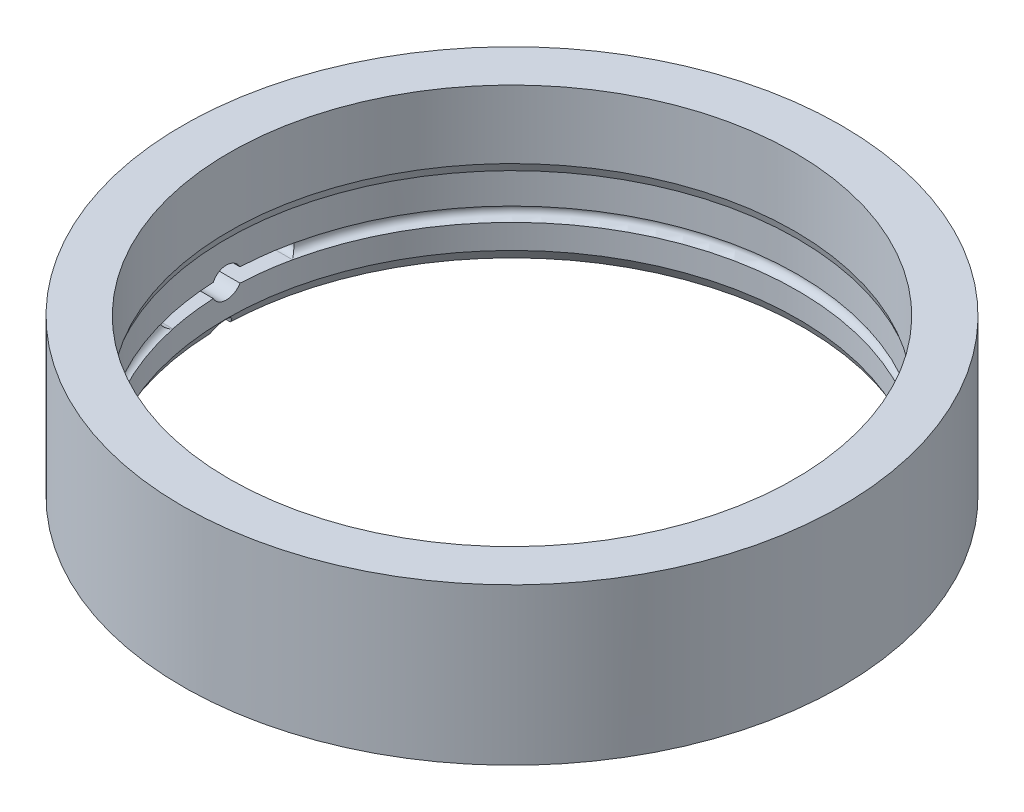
from build123d import *
from build123d.topology import SkipClean

# Parameters (mm, degrees)
SKETCH1_R           = 83.185
SKETCH1_R_2         = 71.3486
BOSS_EXTRUDE1_DEPTH = 29.2862
CHAMFER1_SIZE       = 1.5875
CHAMFER1_SIZE2      = 2.749630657
CUT_EXTRUDE3_START  = -12.675881
CUT_EXTRUDE3_DEPTH  = 12.675881
BOSS_EXTRUDE2_START = 10.16
SKETCH14_R          = 83.185
SKETCH14_R_2        = 72.1106
BOSS_EXTRUDE2_DEPTH = 10.16


with BuildPart() as part:
    # Sketch1 → Boss-Extrude1 (new body)
    with BuildSketch(Plane(origin=(0, 0, 0), x_dir=(1, 0, 0), z_dir=(0, 1, 0))):
        with Locations(Location((0, 0, 0), (0, 0, 270))):
            Circle(SKETCH1_R)
        with Locations(Location((0, 0, 0), (0, 0, 270))):
            Circle(SKETCH1_R_2, mode=Mode.SUBTRACT)
    extrude(amount=BOSS_EXTRUDE1_DEPTH)

    # Sketch4 → Cut-Revolve2 (revolve, cut)
    with BuildSketch(Plane(origin=(0, 0, 0), x_dir=(-1, 0, 0), z_dir=(0, 0, -1)), mode=Mode.PRIVATE) as cut_revolve2_sk:
        with BuildLine():
            Line((71.3486, 0), (72.1106, 0))
            Line((72.1106, 0), (72.1106, 8.89))
            ThreePointArc((72.1106, 8.89), (73.8886, 10.668), (72.1106, 12.446))
            Line((72.1106, 12.446), (72.1106, 29.2862))
            Line((72.1106, 29.2862), (71.3486, 29.2862))
            Line((71.3486, 29.2862), (71.3486, 0))
        make_face()
    revolve(cut_revolve2_sk.sketch.rotate(Axis((0, 0, 0), (0, 1, 0)), 270), axis=Axis((0, 0, 0), (0, 1, 0)), mode=Mode.SUBTRACT)

    # Chamfer1
    chamfer1_edges = [part.edges().sort_by_distance(p)[0] for p in [
        (0, 0, 72.1106),
    ]]
    chamfer1_side = [part.faces().sort_by_distance(p)[0] for p in [
        (0, 0, -80.832172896),
    ]]
    chamfer(chamfer1_edges, length=CHAMFER1_SIZE, length2=CHAMFER1_SIZE2, reference=chamfer1_side[0])

    # Sketch13 → Cut-Extrude3 (cut)
    with BuildSketch(Plane.ZY.offset(83.185).offset(CUT_EXTRUDE3_START)):
        with BuildLine():
            Line((-3.369690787, 8.89), (0, 8.89))
            Line((0, 8.89), (0, 10.668))
            Line((0, 10.668), (-3.81, 10.668))
            ThreePointArc((-3.81, 10.668), (-3.698284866, 9.752145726), (-3.369690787, 8.89))
        make_face()
        with BuildLine():
            Line((0, 10.668), (0, 8.89))
            Line((0, 8.89), (3.369690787, 8.89))
            ThreePointArc((3.369690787, 8.89), (3.698284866, 9.752145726), (3.81, 10.668))
            Line((3.81, 10.668), (0, 10.668))
        make_face()
        with BuildLine():
            Line((-3.369690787, 8.89), (0, 8.89))
            Line((0, 8.89), (0, 10.668))
            Line((0, 10.668), (-3.81, 10.668))
            ThreePointArc((-3.81, 10.668), (-3.698284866, 9.752145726), (-3.369690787, 8.89))
        make_face()
        with BuildLine():
            Line((0, 10.668), (0, 8.89))
            Line((0, 8.89), (3.369690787, 8.89))
            ThreePointArc((3.369690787, 8.89), (3.698284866, 9.752145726), (3.81, 10.668))
            Line((3.81, 10.668), (0, 10.668))
        make_face()
        with BuildLine():
            Line((-3.81, 10.668), (0, 10.668))
            Line((0, 10.668), (0, 12.446))
            Line((0, 12.446), (-3.369690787, 12.446))
            ThreePointArc((-3.369690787, 12.446), (-3.698284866, 11.583854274), (-3.81, 10.668))
        make_face()
        with BuildLine():
            Line((0, 12.446), (0, 10.668))
            Line((0, 10.668), (3.81, 10.668))
            ThreePointArc((3.81, 10.668), (3.698284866, 11.583854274), (3.369690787, 12.446))
            Line((3.369690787, 12.446), (0, 12.446))
        make_face()
        with BuildLine():
            Line((-3.81, 10.668), (0, 10.668))
            Line((0, 10.668), (0, 12.446))
            Line((0, 12.446), (-3.369690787, 12.446))
            ThreePointArc((-3.369690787, 12.446), (-3.698284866, 11.583854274), (-3.81, 10.668))
        make_face()
        with BuildLine():
            Line((0, 12.446), (0, 10.668))
            Line((0, 10.668), (3.81, 10.668))
            ThreePointArc((3.81, 10.668), (3.698284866, 11.583854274), (3.369690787, 12.446))
            Line((3.369690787, 12.446), (0, 12.446))
        make_face()
        with BuildLine():
            Line((-13.335, 10.668), (-3.81, 10.668))
            ThreePointArc((-3.81, 10.668), (-3.698284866, 11.583854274), (-3.369690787, 12.446))
            Line((-3.369690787, 12.446), (-15.113, 12.446))
            ThreePointArc((-15.113, 12.446), (-13.855764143, 11.925235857), (-13.335, 10.668))
        make_face()
        with BuildLine():
            Line((-15.113, 8.89), (-3.81, 8.89))
            Line((-3.81, 8.89), (-3.81, 10.668))
            Line((-3.81, 10.668), (-13.335, 10.668))
            ThreePointArc((-13.335, 10.668), (-13.855764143, 9.410764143), (-15.113, 8.89))
        make_face()
        with BuildLine():
            Line((-3.81, 8.89), (-3.369690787, 8.89))
            ThreePointArc((-3.369690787, 8.89), (-3.698284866, 9.752145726), (-3.81, 10.668))
            Line((-3.81, 10.668), (-3.81, 8.89))
        make_face()
        with BuildLine():
            ThreePointArc((3.81, 10.668), (3.698284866, 9.752145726), (3.369690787, 8.89))
            Line((3.369690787, 8.89), (3.81, 8.89))
            Line((3.81, 8.89), (3.81, 10.668))
        make_face()
        with BuildLine():
            ThreePointArc((3.369690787, 12.446), (3.698284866, 11.583854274), (3.81, 10.668))
            Line((3.81, 10.668), (13.335, 10.668))
            ThreePointArc((13.335, 10.668), (13.855764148, 11.925235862), (15.113000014, 12.446))
            Line((15.113000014, 12.446), (3.369690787, 12.446))
        make_face()
        with BuildLine():
            Line((3.81, 10.668), (3.81, 8.89))
            Line((3.81, 8.89), (15.113, 8.89))
            ThreePointArc((15.113, 8.89), (13.855764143, 9.410764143), (13.335, 10.668))
            Line((13.335, 10.668), (3.81, 10.668))
        make_face()
        with BuildLine():
            ThreePointArc((13.335, 10.668), (13.855764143, 9.410764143), (15.113, 8.89))
            ThreePointArc((15.113, 8.89), (16.370235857, 9.410764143), (16.891, 10.668))
            Line((16.891, 10.668), (13.335, 10.668))
        make_face()
        with BuildLine():
            ThreePointArc((15.113000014, 12.446), (13.855764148, 11.925235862), (13.335, 10.668))
            Line((13.335, 10.668), (16.891, 10.668))
            ThreePointArc((16.891, 10.668), (16.370235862, 11.925235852), (15.113000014, 12.446))
        make_face()
        with BuildLine():
            ThreePointArc((13.335, 10.668), (13.855764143, 9.410764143), (15.113, 8.89))
            ThreePointArc((15.113, 8.89), (16.370235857, 9.410764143), (16.891, 10.668))
            Line((16.891, 10.668), (13.335, 10.668))
        make_face()
        with BuildLine():
            ThreePointArc((15.113000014, 12.446), (13.855764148, 11.925235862), (13.335, 10.668))
            Line((13.335, 10.668), (16.891, 10.668))
            ThreePointArc((16.891, 10.668), (16.370235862, 11.925235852), (15.113000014, 12.446))
        make_face()
        with BuildLine():
            ThreePointArc((-16.891, 10.668), (-16.370235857, 9.410764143), (-15.113, 8.89))
            ThreePointArc((-15.113, 8.89), (-13.855764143, 9.410764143), (-13.335, 10.668))
            Line((-13.335, 10.668), (-16.891, 10.668))
        make_face()
        with BuildLine():
            Line((-16.891, 10.668), (-13.335, 10.668))
            ThreePointArc((-13.335, 10.668), (-13.855764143, 11.925235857), (-15.113, 12.446))
            ThreePointArc((-15.113, 12.446), (-16.370235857, 11.925235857), (-16.891, 10.668))
        make_face()
        with BuildLine():
            ThreePointArc((-16.891, 10.668), (-16.370235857, 9.410764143), (-15.113, 8.89))
            ThreePointArc((-15.113, 8.89), (-13.855764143, 9.410764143), (-13.335, 10.668))
            Line((-13.335, 10.668), (-16.891, 10.668))
        make_face()
        with BuildLine():
            Line((-16.891, 10.668), (-13.335, 10.668))
            ThreePointArc((-13.335, 10.668), (-13.855764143, 11.925235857), (-15.113, 12.446))
            ThreePointArc((-15.113, 12.446), (-16.370235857, 11.925235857), (-16.891, 10.668))
        make_face()
        with BuildLine():
            Line((-2.54, 0), (0, 0))
            Line((0, 0), (0, 2.54))
            ThreePointArc((0, 2.54), (-1.796051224, 1.796051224), (-2.54, 0))
        make_face()
        with BuildLine():
            Line((0, 2.54), (0, 0))
            Line((0, 0), (2.54, 0))
            ThreePointArc((2.54, 0), (1.796051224, 1.796051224), (0, 2.54))
        make_face()
        with BuildLine():
            Line((-2.54, 0), (0, 0))
            Line((0, 0), (0, 2.54))
            ThreePointArc((0, 2.54), (-1.796051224, 1.796051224), (-2.54, 0))
        make_face()
        with BuildLine():
            Line((0, 2.54), (0, 0))
            Line((0, 0), (2.54, 0))
            ThreePointArc((2.54, 0), (1.796051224, 1.796051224), (0, 2.54))
        make_face()
        with BuildLine():
            Line((-3.369690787, 12.446), (0, 12.446))
            Line((0, 12.446), (0, 14.478))
            ThreePointArc((0, 14.478), (-1.96747554, 13.930689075), (-3.369690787, 12.446))
        make_face()
        with BuildLine():
            Line((0, 14.478), (0, 12.446))
            Line((0, 12.446), (3.369690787, 12.446))
            ThreePointArc((3.369690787, 12.446), (1.96747554, 13.930689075), (0, 14.478))
        make_face()
        with BuildLine():
            Line((-3.369690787, 12.446), (0, 12.446))
            Line((0, 12.446), (0, 14.478))
            ThreePointArc((0, 14.478), (-1.96747554, 13.930689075), (-3.369690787, 12.446))
        make_face()
        with BuildLine():
            Line((0, 14.478), (0, 12.446))
            Line((0, 12.446), (3.369690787, 12.446))
            ThreePointArc((3.369690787, 12.446), (1.96747554, 13.930689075), (0, 14.478))
        make_face()
        with BuildLine():
            ThreePointArc((-3.369690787, 8.89), (-1.96747554, 7.405310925), (0, 6.858))
            Line((0, 6.858), (0, 8.89))
            Line((0, 8.89), (-3.369690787, 8.89))
        make_face()
        with BuildLine():
            Line((0, 8.89), (0, 6.858))
            ThreePointArc((0, 6.858), (1.96747554, 7.405310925), (3.369690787, 8.89))
            Line((3.369690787, 8.89), (0, 8.89))
        make_face()
        with BuildLine():
            ThreePointArc((-3.369690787, 8.89), (-1.96747554, 7.405310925), (0, 6.858))
            Line((0, 6.858), (0, 8.89))
            Line((0, 8.89), (-3.369690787, 8.89))
        make_face()
        with BuildLine():
            Line((0, 8.89), (0, 6.858))
            ThreePointArc((0, 6.858), (1.96747554, 7.405310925), (3.369690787, 8.89))
            Line((3.369690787, 8.89), (0, 8.89))
        make_face()
    extrude(amount=CUT_EXTRUDE3_DEPTH, mode=Mode.SUBTRACT)

    # Sketch14 → Boss-Extrude2 (add)
    with SkipClean():  # the faces are left unmerged after this step: merging them gives an invalid solid
        with BuildSketch(Plane(origin=(0, 29.2862, 0), x_dir=(1, 0, 0), z_dir=(0, 1, 0)).offset(BOSS_EXTRUDE2_START)):
            with Locations(Location((0, 0, 0), (0, 0, 178.25023858))):
                Circle(SKETCH14_R)
            with Locations(Location((0, 0, 0), (0, 0, 167.902210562))):
                Circle(SKETCH14_R_2, mode=Mode.SUBTRACT)
        extrude(amount=-BOSS_EXTRUDE2_DEPTH)

    # Sketch20 → Revolve2 (revolve)
    with SkipClean():  # the faces are left unmerged after this step: merging them gives an invalid solid
        with BuildSketch(Plane.ZY, mode=Mode.PRIVATE) as revolve2_sk:
            Polygon((-72.1106, 39.4462), (-72.1106, 20.193), (-71.352522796, 22.2758), (-71.352522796, 39.4462), align=None)
        revolve(revolve2_sk.sketch.rotate(Axis((0, 0, 0), (0, -1, 0)), 282.097789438), axis=Axis((0, 0, 0), (0, -1, 0)))


solid = part.part
